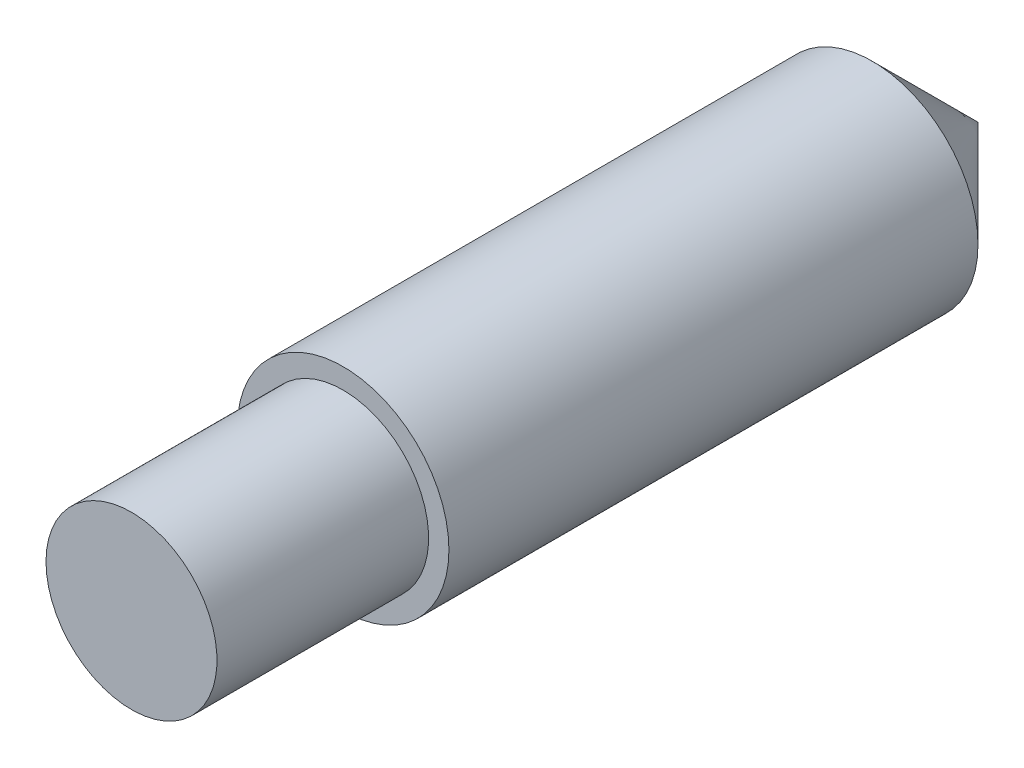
from build123d import *


with BuildPart() as part:
    # Sketch1 → Revolve1 (revolve)
    with BuildSketch(Plane(origin=(0, 0, 0), x_dir=(0, 0, -1), z_dir=(1, 0, 0)), mode=Mode.PRIVATE) as revolve1_sk:
        Polygon((0, 0), (0, 1.2827), (3.175, 1.2827), (3.175, 1.5875), (11.1125, 1.5875), (12.7, 0), align=None)
    revolve(revolve1_sk.sketch.rotate(Axis((0, 0, 0), (0, 0, 1)), 90), axis=Axis((0, 0, 0), (0, 0, 1)))


solid = part.part
